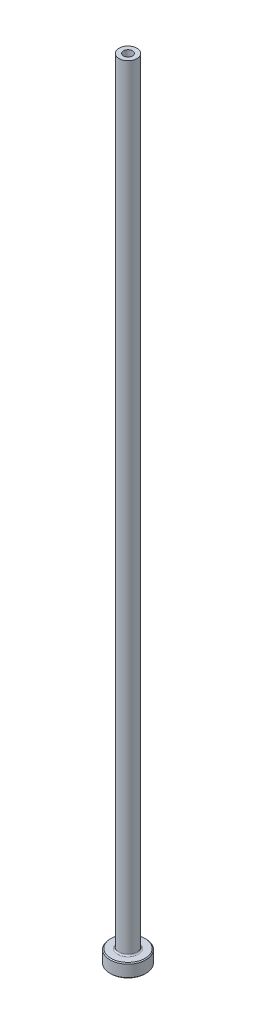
ISO-10303-21;
HEADER;
FILE_DESCRIPTION(('STEP AP214'),'2;1');
FILE_NAME('part.step','',(''),(''),'','','');
FILE_SCHEMA(('AUTOMOTIVE_DESIGN { 1 0 10303 214 1 1 1 1 }'));
ENDSEC;
DATA;
#1=APPLICATION_CONTEXT('core data for automotive mechanical design processes');
#2=APPLICATION_PROTOCOL_DEFINITION('international standard','automotive_design',2000,#1);
#3=PRODUCT_CONTEXT('',#1,'mechanical');
#4=PRODUCT('Part','Part','',(#3));
#5=PRODUCT_RELATED_PRODUCT_CATEGORY('part','',(#4));
#6=PRODUCT_DEFINITION_FORMATION('','',#4);
#7=PRODUCT_DEFINITION_CONTEXT('part definition',#1,'design');
#8=PRODUCT_DEFINITION('design','',#6,#7);
#9=PRODUCT_DEFINITION_SHAPE('','',#8);
#10=(LENGTH_UNIT() NAMED_UNIT(*) SI_UNIT(.MILLI.,.METRE.));
#11=(NAMED_UNIT(*) PLANE_ANGLE_UNIT() SI_UNIT($,.RADIAN.));
#12=(NAMED_UNIT(*) SI_UNIT($,.STERADIAN.) SOLID_ANGLE_UNIT());
#13=UNCERTAINTY_MEASURE_WITH_UNIT(LENGTH_MEASURE(1.E-05),#10,'distance_accuracy_value','');
#14=(GEOMETRIC_REPRESENTATION_CONTEXT(3) GLOBAL_UNCERTAINTY_ASSIGNED_CONTEXT((#13)) GLOBAL_UNIT_ASSIGNED_CONTEXT((#10,
#11,#12)) REPRESENTATION_CONTEXT('',''));
#15=CARTESIAN_POINT('',(0.,0.,0.));
#16=DIRECTION('',(0.,0.,1.));
#17=DIRECTION('',(1.,0.,0.));
#18=AXIS2_PLACEMENT_3D('',#15,#16,#17);
#19=CARTESIAN_POINT('',(0.,92.1876809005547,0.));
#20=DIRECTION('',(0.,1.,0.));
#21=DIRECTION('',(0.,0.,1.));
#22=AXIS2_PLACEMENT_3D('',#19,#20,#21);
#23=CYLINDRICAL_SURFACE('',#22,1.);
#24=CARTESIAN_POINT('',(0.,175.,0.));
#25=DIRECTION('',(0.,1.,0.));
#26=DIRECTION('',(0.,0.,1.));
#27=AXIS2_PLACEMENT_3D('',#24,#25,#26);
#28=CIRCLE('',#27,1.);
#29=CARTESIAN_POINT('',(0.,175.,1.));
#30=VERTEX_POINT('',#29);
#31=EDGE_CURVE('E62',#30,#30,#28,.T.);
#32=ORIENTED_EDGE('',*,*,#31,.T.);
#33=EDGE_LOOP('',(#32));
#34=FACE_BOUND('',#33,.T.);
#35=CARTESIAN_POINT('',(0.,140.,0.));
#36=DIRECTION('',(0.,1.,0.));
#37=DIRECTION('',(0.,0.,1.));
#38=AXIS2_PLACEMENT_3D('',#35,#36,#37);
#39=CIRCLE('',#38,1.);
#40=CARTESIAN_POINT('',(0.,140.,1.));
#41=VERTEX_POINT('',#40);
#42=EDGE_CURVE('E71',#41,#41,#39,.T.);
#43=ORIENTED_EDGE('',*,*,#42,.F.);
#44=EDGE_LOOP('',(#43));
#45=FACE_BOUND('',#44,.T.);
#46=ADVANCED_FACE('F30',(#34,#45),#23,.F.);
#47=CARTESIAN_POINT('',(-1.,175.,0.));
#48=DIRECTION('',(0.,1.,0.));
#49=DIRECTION('',(0.,0.,1.));
#50=AXIS2_PLACEMENT_3D('',#47,#48,#49);
#51=PLANE('',#50);
#52=CARTESIAN_POINT('',(0.,175.,0.));
#53=DIRECTION('',(0.,1.,0.));
#54=DIRECTION('',(0.,0.,1.));
#55=AXIS2_PLACEMENT_3D('',#52,#53,#54);
#56=CIRCLE('',#55,2.00000000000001);
#57=CARTESIAN_POINT('',(0.,175.,2.00000000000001));
#58=VERTEX_POINT('',#57);
#59=EDGE_CURVE('E65',#58,#58,#56,.T.);
#60=ORIENTED_EDGE('',*,*,#59,.T.);
#61=EDGE_LOOP('',(#60));
#62=FACE_BOUND('',#61,.T.);
#63=ORIENTED_EDGE('',*,*,#31,.F.);
#64=EDGE_LOOP('',(#63));
#65=FACE_BOUND('',#64,.T.);
#66=ADVANCED_FACE('F79',(#62,#65),#51,.T.);
#67=CARTESIAN_POINT('',(0.,92.1876809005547,0.));
#68=DIRECTION('',(0.,1.,0.));
#69=DIRECTION('',(0.,0.,1.));
#70=AXIS2_PLACEMENT_3D('',#67,#68,#69);
#71=CYLINDRICAL_SURFACE('',#70,2.);
#72=CARTESIAN_POINT('',(0.,3.3,0.));
#73=DIRECTION('',(0.,1.,0.));
#74=DIRECTION('',(0.,0.,1.));
#75=AXIS2_PLACEMENT_3D('',#72,#73,#74);
#76=CIRCLE('',#75,2.);
#77=CARTESIAN_POINT('',(0.,3.3,2.));
#78=VERTEX_POINT('',#77);
#79=EDGE_CURVE('E59',#78,#78,#76,.T.);
#80=ORIENTED_EDGE('',*,*,#79,.T.);
#81=EDGE_LOOP('',(#80));
#82=FACE_BOUND('',#81,.T.);
#83=ORIENTED_EDGE('',*,*,#59,.F.);
#84=EDGE_LOOP('',(#83));
#85=FACE_BOUND('',#84,.T.);
#86=ADVANCED_FACE('F85',(#82,#85),#71,.T.);
#87=CARTESIAN_POINT('',(-1.99999999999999,3.,0.));
#88=DIRECTION('',(0.,1.,0.));
#89=DIRECTION('',(0.,0.,1.));
#90=AXIS2_PLACEMENT_3D('',#87,#88,#89);
#91=PLANE('',#90);
#92=CARTESIAN_POINT('',(0.,3.,0.));
#93=DIRECTION('',(0.,1.,0.));
#94=DIRECTION('',(0.,0.,1.));
#95=AXIS2_PLACEMENT_3D('',#92,#93,#94);
#96=CIRCLE('',#95,3.79999999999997);
#97=CARTESIAN_POINT('',(0.,3.,3.79999999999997));
#98=VERTEX_POINT('',#97);
#99=EDGE_CURVE('E53',#98,#98,#96,.T.);
#100=ORIENTED_EDGE('',*,*,#99,.T.);
#101=EDGE_LOOP('',(#100));
#102=FACE_BOUND('',#101,.T.);
#103=CARTESIAN_POINT('',(0.,3.,0.));
#104=DIRECTION('',(0.,1.,0.));
#105=DIRECTION('',(0.,0.,1.));
#106=AXIS2_PLACEMENT_3D('',#103,#104,#105);
#107=CIRCLE('',#106,2.3);
#108=CARTESIAN_POINT('',(0.,3.,2.3));
#109=VERTEX_POINT('',#108);
#110=EDGE_CURVE('E56',#109,#109,#107,.F.);
#111=ORIENTED_EDGE('',*,*,#110,.T.);
#112=EDGE_LOOP('',(#111));
#113=FACE_BOUND('',#112,.T.);
#114=ADVANCED_FACE('F111',(#102,#113),#91,.T.);
#115=CARTESIAN_POINT('',(0.,92.1876809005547,0.));
#116=DIRECTION('',(0.,1.,0.));
#117=DIRECTION('',(0.,0.,1.));
#118=AXIS2_PLACEMENT_3D('',#115,#116,#117);
#119=CYLINDRICAL_SURFACE('',#118,3.99999999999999);
#120=CARTESIAN_POINT('',(0.,2.79999999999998,0.));
#121=DIRECTION('',(0.,1.,0.));
#122=DIRECTION('',(0.,0.,1.));
#123=AXIS2_PLACEMENT_3D('',#120,#121,#122);
#124=CIRCLE('',#123,3.99999999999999);
#125=CARTESIAN_POINT('',(0.,2.79999999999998,3.99999999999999));
#126=VERTEX_POINT('',#125);
#127=EDGE_CURVE('E45',#126,#126,#124,.F.);
#128=ORIENTED_EDGE('',*,*,#127,.T.);
#129=EDGE_LOOP('',(#128));
#130=FACE_BOUND('',#129,.T.);
#131=CARTESIAN_POINT('',(0.,0.199999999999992,0.));
#132=DIRECTION('',(0.,-1.,0.));
#133=DIRECTION('',(0.,0.,-1.));
#134=AXIS2_PLACEMENT_3D('',#131,#132,#133);
#135=CIRCLE('',#134,3.99999999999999);
#136=CARTESIAN_POINT('',(0.,0.199999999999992,-3.99999999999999));
#137=VERTEX_POINT('',#136);
#138=EDGE_CURVE('E50',#137,#137,#135,.F.);
#139=ORIENTED_EDGE('',*,*,#138,.T.);
#140=EDGE_LOOP('',(#139));
#141=FACE_BOUND('',#140,.T.);
#142=ADVANCED_FACE('F108',(#130,#141),#119,.T.);
#143=CARTESIAN_POINT('',(-3.99999999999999,0.,0.));
#144=DIRECTION('',(0.,-1.,0.));
#145=DIRECTION('',(0.,0.,-1.));
#146=AXIS2_PLACEMENT_3D('',#143,#144,#145);
#147=PLANE('',#146);
#148=CARTESIAN_POINT('',(0.,0.,0.));
#149=DIRECTION('',(0.,-1.,0.));
#150=DIRECTION('',(0.,0.,-1.));
#151=AXIS2_PLACEMENT_3D('',#148,#149,#150);
#152=CIRCLE('',#151,1.74999999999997);
#153=CARTESIAN_POINT('',(0.,0.,-1.74999999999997));
#154=VERTEX_POINT('',#153);
#155=EDGE_CURVE('E37',#154,#154,#152,.F.);
#156=ORIENTED_EDGE('',*,*,#155,.T.);
#157=EDGE_LOOP('',(#156));
#158=FACE_BOUND('',#157,.T.);
#159=CARTESIAN_POINT('',(0.,0.,0.));
#160=DIRECTION('',(0.,-1.,0.));
#161=DIRECTION('',(0.,0.,-1.));
#162=AXIS2_PLACEMENT_3D('',#159,#160,#161);
#163=CIRCLE('',#162,3.8);
#164=CARTESIAN_POINT('',(0.,0.,-3.8));
#165=VERTEX_POINT('',#164);
#166=EDGE_CURVE('E41',#165,#165,#163,.T.);
#167=ORIENTED_EDGE('',*,*,#166,.T.);
#168=EDGE_LOOP('',(#167));
#169=FACE_BOUND('',#168,.T.);
#170=ADVANCED_FACE('F110',(#158,#169),#147,.T.);
#171=CARTESIAN_POINT('',(0.,92.1876809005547,0.));
#172=DIRECTION('',(0.,1.,0.));
#173=DIRECTION('',(0.,0.,1.));
#174=AXIS2_PLACEMENT_3D('',#171,#172,#173);
#175=CYLINDRICAL_SURFACE('',#174,1.25);
#176=CARTESIAN_POINT('',(0.,0.499999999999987,0.));
#177=DIRECTION('',(0.,-1.,0.));
#178=DIRECTION('',(0.,0.,-1.));
#179=AXIS2_PLACEMENT_3D('',#176,#177,#178);
#180=CIRCLE('',#179,1.25);
#181=CARTESIAN_POINT('',(0.,0.499999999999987,-1.25));
#182=VERTEX_POINT('',#181);
#183=EDGE_CURVE('E10',#182,#182,#180,.T.);
#184=ORIENTED_EDGE('',*,*,#183,.T.);
#185=EDGE_LOOP('',(#184));
#186=FACE_BOUND('',#185,.T.);
#187=CARTESIAN_POINT('',(0.,128.,0.));
#188=DIRECTION('',(0.,1.,0.));
#189=DIRECTION('',(0.,0.,1.));
#190=AXIS2_PLACEMENT_3D('',#187,#188,#189);
#191=CIRCLE('',#190,1.25000000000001);
#192=CARTESIAN_POINT('',(0.,128.,1.25000000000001));
#193=VERTEX_POINT('',#192);
#194=EDGE_CURVE('E68',#193,#193,#191,.T.);
#195=ORIENTED_EDGE('',*,*,#194,.T.);
#196=EDGE_LOOP('',(#195));
#197=FACE_BOUND('',#196,.T.);
#198=ADVANCED_FACE('F118',(#186,#197),#175,.F.);
#199=CARTESIAN_POINT('',(0.,128.,0.));
#200=DIRECTION('',(0.,-1.,0.));
#201=DIRECTION('',(0.,0.,-1.));
#202=AXIS2_PLACEMENT_3D('',#199,#200,#201);
#203=CONICAL_SURFACE('',#202,1.25000000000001,0.0208303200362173);
#204=ORIENTED_EDGE('',*,*,#42,.T.);
#205=EDGE_LOOP('',(#204));
#206=FACE_BOUND('',#205,.T.);
#207=ORIENTED_EDGE('',*,*,#194,.F.);
#208=EDGE_LOOP('',(#207));
#209=FACE_BOUND('',#208,.T.);
#210=ADVANCED_FACE('F75',(#206,#209),#203,.F.);
#211=CARTESIAN_POINT('',(0.,3.3,0.));
#212=DIRECTION('',(0.,1.,0.));
#213=DIRECTION('',(0.,0.,1.));
#214=AXIS2_PLACEMENT_3D('',#211,#212,#213);
#215=TOROIDAL_SURFACE('',#214,2.3,0.3);
#216=ORIENTED_EDGE('',*,*,#110,.F.);
#217=EDGE_LOOP('',(#216));
#218=FACE_BOUND('',#217,.T.);
#219=ORIENTED_EDGE('',*,*,#79,.F.);
#220=EDGE_LOOP('',(#219));
#221=FACE_BOUND('',#220,.T.);
#222=ADVANCED_FACE('F90',(#218,#221),#215,.F.);
#223=CARTESIAN_POINT('',(0.,3.,0.));
#224=DIRECTION('',(0.,-1.,0.));
#225=DIRECTION('',(0.,0.,-1.));
#226=AXIS2_PLACEMENT_3D('',#223,#224,#225);
#227=CONICAL_SURFACE('',#226,3.79999999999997,0.785398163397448);
#228=ORIENTED_EDGE('',*,*,#127,.F.);
#229=EDGE_LOOP('',(#228));
#230=FACE_BOUND('',#229,.T.);
#231=ORIENTED_EDGE('',*,*,#99,.F.);
#232=EDGE_LOOP('',(#231));
#233=FACE_BOUND('',#232,.T.);
#234=ADVANCED_FACE('F93',(#230,#233),#227,.T.);
#235=CARTESIAN_POINT('',(0.,0.199999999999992,0.));
#236=DIRECTION('',(0.,1.,0.));
#237=DIRECTION('',(0.,0.,1.));
#238=AXIS2_PLACEMENT_3D('',#235,#236,#237);
#239=CONICAL_SURFACE('',#238,3.99999999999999,0.785398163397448);
#240=ORIENTED_EDGE('',*,*,#166,.F.);
#241=EDGE_LOOP('',(#240));
#242=FACE_BOUND('',#241,.T.);
#243=ORIENTED_EDGE('',*,*,#138,.F.);
#244=EDGE_LOOP('',(#243));
#245=FACE_BOUND('',#244,.T.);
#246=ADVANCED_FACE('F96',(#242,#245),#239,.T.);
#247=CARTESIAN_POINT('',(0.,0.,0.));
#248=DIRECTION('',(0.,-1.,0.));
#249=DIRECTION('',(0.,0.,-1.));
#250=AXIS2_PLACEMENT_3D('',#247,#248,#249);
#251=CONICAL_SURFACE('',#250,1.74999999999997,0.785398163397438);
#252=ORIENTED_EDGE('',*,*,#183,.F.);
#253=EDGE_LOOP('',(#252));
#254=FACE_BOUND('',#253,.T.);
#255=ORIENTED_EDGE('',*,*,#155,.F.);
#256=EDGE_LOOP('',(#255));
#257=FACE_BOUND('',#256,.T.);
#258=ADVANCED_FACE('F32',(#254,#257),#251,.F.);
#259=CLOSED_SHELL('',(#46,#66,#86,#114,#142,#170,#198,#210,#222,#234,#246,#258));
#260=MANIFOLD_SOLID_BREP('B2',#259);
#261=ADVANCED_BREP_SHAPE_REPRESENTATION('',(#18,#260),#14);
#262=SHAPE_DEFINITION_REPRESENTATION(#9,#261);
ENDSEC;
END-ISO-10303-21;
